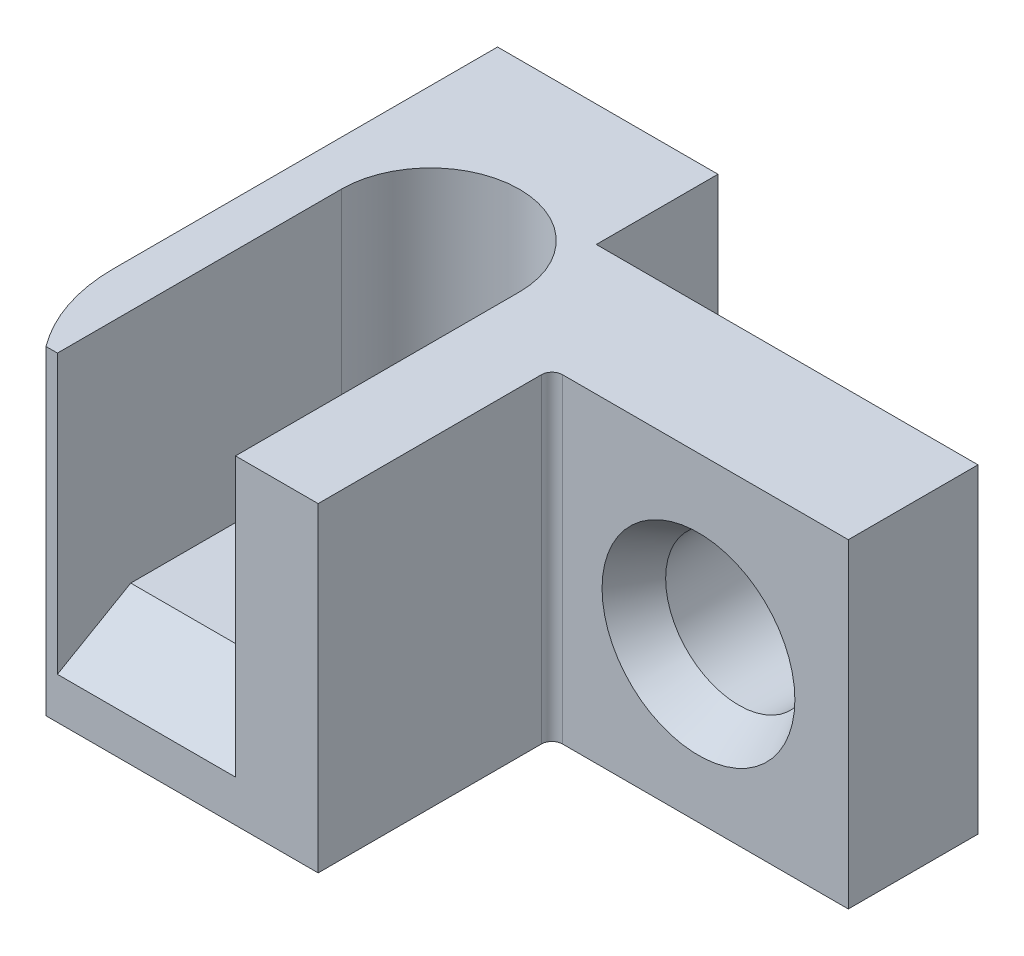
from build123d import *

# Parameters (mm, degrees)
EXTRUDE_1_DEPTH     = 12.0904
SKETCH_2_R          = 2.76479
CUT_EXTRUDE_1_DEPTH = 28.46570485
CUT_EXTRUDE_2_DEPTH = 8.9154
CUT_EXTRUDE_3_DEPTH = 6.731
CUT_EXTRUDE_4_DEPTH = 4.5974
CHAMFER_1_SIZE      = 1.524
CHAMFER_1_SIZE2     = 0.87988181


with BuildPart() as part:
    # Sketch 1 → Extrude 1 (new body)
    with BuildSketch(Plane(origin=(0, 0, 0), x_dir=(1, 0, 0), z_dir=(0, 1, 0))):
        with BuildLine():
            Line((0, 0), (8.3312, 0))
            Line((8.3312, 0), (8.3312, -4.5974))
            Line((8.3312, -4.5974), (22.7584, -4.5974))
            Line((22.7584, -4.5974), (22.7584, -9.4996))
            Line((22.7584, -9.4996), (11.953875, -9.4996))
            ThreePointArc((11.953875, -9.4996), (11.673241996, -9.615841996), (11.557, -9.896475))
            Line((11.557, -9.896475), (11.557, -18.3388))
            Line((11.557, -18.3388), (1.27, -18.3388))
            ThreePointArc((1.27, -18.3388), (0.325861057, -16.536846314), (0, -14.5288))
            Line((0, -14.5288), (0, 0))
        make_face()
    extrude(amount=EXTRUDE_1_DEPTH)

    # Sketch 2 → Cut-Extrude 1 (cut, through all)
    with BuildSketch(Plane.XY.offset(9.4996)):
        with Locations((17.0942, 5.842)):
            Circle(SKETCH_2_R)
    extrude(amount=-CUT_EXTRUDE_1_DEPTH, mode=Mode.SUBTRACT)

    # Sketch 3 → Cut-Extrude 2 (cut)
    with BuildSketch(Plane(origin=(0, 12.0904, 0), x_dir=(1, 0, 0), z_dir=(0, 1, 0))):
        with BuildLine():
            Line((1.7018, -7.6073), (1.7018, -18.3388))
            Line((1.7018, -18.3388), (8.4328, -18.3388))
            Line((8.4328, -18.3388), (8.4328, -7.6073))
            ThreePointArc((8.4328, -7.6073), (5.0673, -4.2418), (1.7018, -7.6073))
        make_face()
    extrude(amount=-CUT_EXTRUDE_2_DEPTH, mode=Mode.SUBTRACT)

    # Sketch 4 → Cut-Extrude 3 (cut)
    with BuildSketch(Plane(origin=(1.7018, 0, 0), x_dir=(0, 0, -1), z_dir=(1, 0, 0))):
        Polygon((-15.567172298, 3.175), (-18.3388, 3.175), (-18.3388, 1.5748), align=None)
    extrude(amount=CUT_EXTRUDE_3_DEPTH, mode=Mode.SUBTRACT)

    # Sketch 5 → Cut-Extrude 4 (cut)
    with BuildSketch(Plane(origin=(0, 0, 0), x_dir=(-1, 0, 0), z_dir=(0, 0, -1))):
        with BuildLine():
            Line((-5.0292, 0), (-8.3312, 0))
            Line((-8.3312, 0), (-8.3312, 3.302))
            ThreePointArc((-8.3312, 3.302), (-7.364066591, 0.967133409), (-5.0292, 0))
        make_face()
    extrude(amount=-CUT_EXTRUDE_4_DEPTH, mode=Mode.SUBTRACT)

    # Chamfer 1
    chamfer_1_edges = [part.edges().sort_by_distance(p)[0] for p in [
        (14.32941, 5.842, 9.4996),
    ]]
    chamfer_1_side = [part.faces().sort_by_distance(p)[0] for p in [
        (14.32941, 5.842, 7.0485),
    ]]
    chamfer(chamfer_1_edges, length=CHAMFER_1_SIZE, length2=CHAMFER_1_SIZE2, reference=chamfer_1_side[0])


solid = part.part
